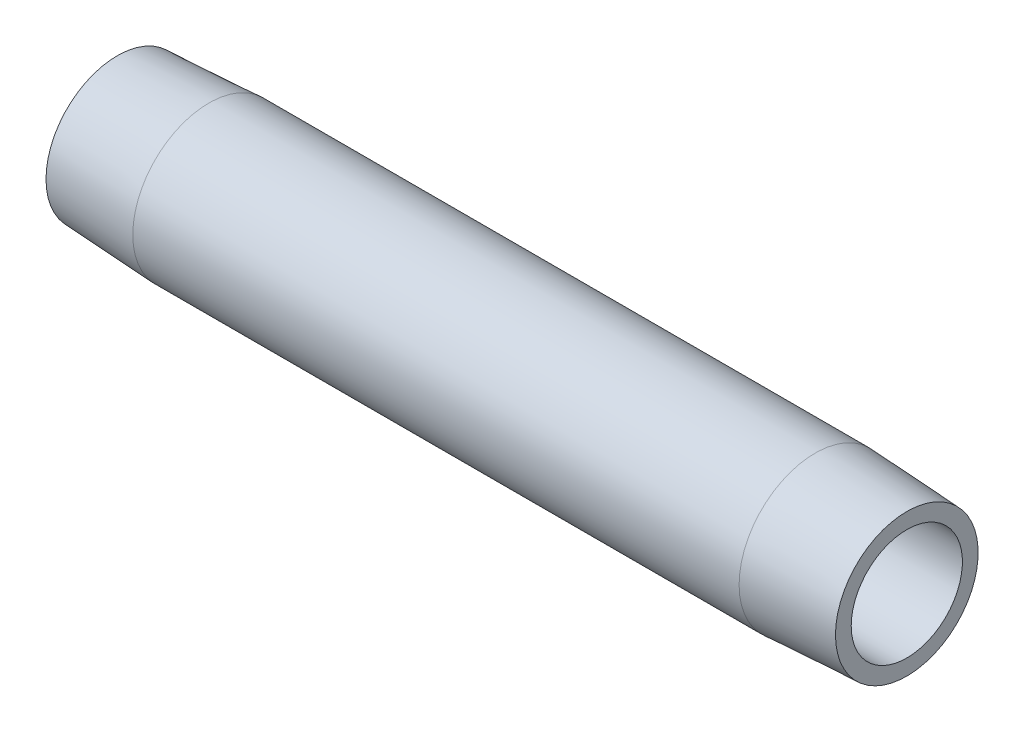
from build123d import *


with BuildPart() as part:
    # Sketch1 → Revolve1 (revolve)
    with BuildSketch(Plane.XY, mode=Mode.PRIVATE) as revolve1_sk:
        Polygon((88.9, 6.2611), (0, 6.2611), (0, 8.032050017), (10.3124, 8.5725), (78.5876, 8.5725), (88.9, 8.032050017), align=None)
    revolve(revolve1_sk.sketch.rotate(Axis((0, 0, 0), (1, 0, 0)), 90), axis=Axis((0, 0, 0), (1, 0, 0)))


solid = part.part
